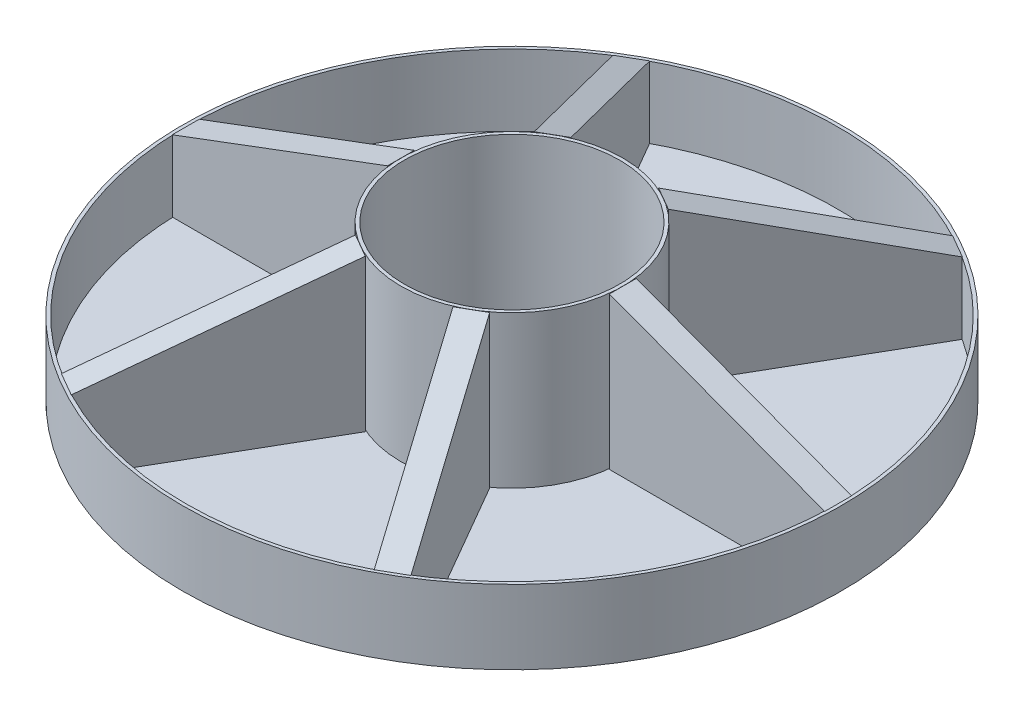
ISO-10303-21;
HEADER;
FILE_DESCRIPTION(('STEP AP214'),'2;1');
FILE_NAME('part.step','',(''),(''),'','','');
FILE_SCHEMA(('AUTOMOTIVE_DESIGN { 1 0 10303 214 1 1 1 1 }'));
ENDSEC;
DATA;
#1=APPLICATION_CONTEXT('core data for automotive mechanical design processes');
#2=APPLICATION_PROTOCOL_DEFINITION('international standard','automotive_design',2000,#1);
#3=PRODUCT_CONTEXT('',#1,'mechanical');
#4=PRODUCT('Part','Part','',(#3));
#5=PRODUCT_RELATED_PRODUCT_CATEGORY('part','',(#4));
#6=PRODUCT_DEFINITION_FORMATION('','',#4);
#7=PRODUCT_DEFINITION_CONTEXT('part definition',#1,'design');
#8=PRODUCT_DEFINITION('design','',#6,#7);
#9=PRODUCT_DEFINITION_SHAPE('','',#8);
#10=(LENGTH_UNIT() NAMED_UNIT(*) SI_UNIT(.MILLI.,.METRE.));
#11=(NAMED_UNIT(*) PLANE_ANGLE_UNIT() SI_UNIT($,.RADIAN.));
#12=(NAMED_UNIT(*) SI_UNIT($,.STERADIAN.) SOLID_ANGLE_UNIT());
#13=UNCERTAINTY_MEASURE_WITH_UNIT(LENGTH_MEASURE(1.E-05),#10,'distance_accuracy_value','');
#14=(GEOMETRIC_REPRESENTATION_CONTEXT(3) GLOBAL_UNCERTAINTY_ASSIGNED_CONTEXT((#13)) GLOBAL_UNIT_ASSIGNED_CONTEXT((#10,
#11,#12)) REPRESENTATION_CONTEXT('',''));
#15=CARTESIAN_POINT('',(0.,0.,0.));
#16=DIRECTION('',(0.,0.,1.));
#17=DIRECTION('',(1.,0.,0.));
#18=AXIS2_PLACEMENT_3D('',#15,#16,#17);
#19=CARTESIAN_POINT('',(-0.433012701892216,0.1,0.250000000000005));
#20=DIRECTION('',(0.,-1.,0.));
#21=DIRECTION('',(0.50000000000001,0.,0.866025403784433));
#22=AXIS2_PLACEMENT_3D('',#19,#20,#21);
#23=PLANE('',#22);
#24=DIRECTION('',(-0.50000000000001,0.,-0.866025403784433));
#25=VECTOR('',#24,1.);
#26=CARTESIAN_POINT('',(0.433012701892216,0.1,-0.250000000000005));
#27=LINE('',#26,#25);
#28=CARTESIAN_POINT('',(-1.62948729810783,0.1,-3.82235479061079));
#29=VERTEX_POINT('',#28);
#30=CARTESIAN_POINT('',(-5.6294872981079,0.0999999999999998,-10.7505580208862));
#31=VERTEX_POINT('',#30);
#32=EDGE_CURVE('E124',#29,#31,#27,.T.);
#33=ORIENTED_EDGE('',*,*,#32,.F.);
#34=DIRECTION('',(0.866025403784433,0.,-0.50000000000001));
#35=VECTOR('',#34,1.);
#36=CARTESIAN_POINT('',(-2.49551270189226,0.1,-3.32235479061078));
#37=LINE('',#36,#35);
#38=CARTESIAN_POINT('',(-2.49551270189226,0.1,-3.32235479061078));
#39=VERTEX_POINT('',#38);
#40=EDGE_CURVE('E13',#39,#29,#37,.T.);
#41=ORIENTED_EDGE('',*,*,#40,.F.);
#42=DIRECTION('',(-0.50000000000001,0.,-0.866025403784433));
#43=VECTOR('',#42,1.);
#44=CARTESIAN_POINT('',(-0.433012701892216,0.1,0.250000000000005));
#45=LINE('',#44,#43);
#46=CARTESIAN_POINT('',(-6.49551270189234,0.0999999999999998,-10.2505580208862));
#47=VERTEX_POINT('',#46);
#48=EDGE_CURVE('E107',#39,#47,#45,.T.);
#49=ORIENTED_EDGE('',*,*,#48,.T.);
#50=DIRECTION('',(0.866025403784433,0.,-0.50000000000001));
#51=VECTOR('',#50,1.);
#52=CARTESIAN_POINT('',(-6.49551270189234,0.0999999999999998,-10.2505580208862));
#53=LINE('',#52,#51);
#54=EDGE_CURVE('E78',#47,#31,#53,.T.);
#55=ORIENTED_EDGE('',*,*,#54,.T.);
#56=EDGE_LOOP('',(#33,#41,#49,#55));
#57=FACE_BOUND('',#56,.T.);
#58=ADVANCED_FACE('F58',(#57),#23,.T.);
#59=CARTESIAN_POINT('',(-2.49551270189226,0.,-3.32235479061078));
#60=DIRECTION('',(-0.50000000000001,0.,-0.866025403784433));
#61=DIRECTION('',(-0.866025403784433,0.,0.50000000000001));
#62=AXIS2_PLACEMENT_3D('',#59,#60,#61);
#63=PLANE('',#62);
#64=DIRECTION('',(0.,1.,0.));
#65=VECTOR('',#64,1.);
#66=CARTESIAN_POINT('',(-1.62948729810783,0.,-3.82235479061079));
#67=LINE('',#66,#65);
#68=CARTESIAN_POINT('',(-1.62948729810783,5.75,-3.82235479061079));
#69=VERTEX_POINT('',#68);
#70=EDGE_CURVE('E111',#29,#69,#67,.T.);
#71=ORIENTED_EDGE('',*,*,#70,.T.);
#72=DIRECTION('',(0.866025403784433,0.,-0.50000000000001));
#73=VECTOR('',#72,1.);
#74=CARTESIAN_POINT('',(-2.49551270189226,5.75,-3.32235479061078));
#75=LINE('',#74,#73);
#76=CARTESIAN_POINT('',(-2.49551270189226,5.75,-3.32235479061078));
#77=VERTEX_POINT('',#76);
#78=EDGE_CURVE('E69',#77,#69,#75,.T.);
#79=ORIENTED_EDGE('',*,*,#78,.F.);
#80=DIRECTION('',(0.,1.,0.));
#81=VECTOR('',#80,1.);
#82=CARTESIAN_POINT('',(-2.49551270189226,0.,-3.32235479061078));
#83=LINE('',#82,#81);
#84=EDGE_CURVE('E105',#39,#77,#83,.T.);
#85=ORIENTED_EDGE('',*,*,#84,.F.);
#86=ORIENTED_EDGE('',*,*,#40,.T.);
#87=EDGE_LOOP('',(#71,#79,#85,#86));
#88=FACE_BOUND('',#87,.T.);
#89=ADVANCED_FACE('F115',(#88),#63,.F.);
#90=CARTESIAN_POINT('',(-1.6324990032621,6.3972602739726,-1.82757121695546));
#91=DIRECTION('',(0.1755617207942,-0.936329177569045,0.304081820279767));
#92=DIRECTION('',(0.468164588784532,0.351123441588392,0.810884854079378));
#93=AXIS2_PLACEMENT_3D('',#90,#91,#92);
#94=PLANE('',#93);
#95=DIRECTION('',(-0.468164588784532,-0.351123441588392,-0.810884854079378));
#96=VECTOR('',#95,1.);
#97=CARTESIAN_POINT('',(-0.766473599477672,6.3972602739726,-2.32757121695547));
#98=LINE('',#97,#96);
#99=CARTESIAN_POINT('',(-5.6294872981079,2.75,-10.7505580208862));
#100=VERTEX_POINT('',#99);
#101=EDGE_CURVE('E127',#69,#100,#98,.T.);
#102=ORIENTED_EDGE('',*,*,#101,.T.);
#103=DIRECTION('',(0.866025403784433,0.,-0.50000000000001));
#104=VECTOR('',#103,1.);
#105=CARTESIAN_POINT('',(-6.49551270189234,2.75,-10.2505580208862));
#106=LINE('',#105,#104);
#107=CARTESIAN_POINT('',(-6.49551270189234,2.75,-10.2505580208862));
#108=VERTEX_POINT('',#107);
#109=EDGE_CURVE('E89',#108,#100,#106,.T.);
#110=ORIENTED_EDGE('',*,*,#109,.F.);
#111=DIRECTION('',(-0.468164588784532,-0.351123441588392,-0.810884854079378));
#112=VECTOR('',#111,1.);
#113=CARTESIAN_POINT('',(-1.6324990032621,6.3972602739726,-1.82757121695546));
#114=LINE('',#113,#112);
#115=EDGE_CURVE('E110',#77,#108,#114,.T.);
#116=ORIENTED_EDGE('',*,*,#115,.F.);
#117=ORIENTED_EDGE('',*,*,#78,.T.);
#118=EDGE_LOOP('',(#102,#110,#116,#117));
#119=FACE_BOUND('',#118,.T.);
#120=ADVANCED_FACE('F119',(#119),#94,.F.);
#121=CARTESIAN_POINT('',(-6.49551270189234,0.,-10.2505580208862));
#122=DIRECTION('',(-0.50000000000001,0.,-0.866025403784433));
#123=DIRECTION('',(-0.866025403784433,0.,0.50000000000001));
#124=AXIS2_PLACEMENT_3D('',#121,#122,#123);
#125=PLANE('',#124);
#126=DIRECTION('',(0.,1.,0.));
#127=VECTOR('',#126,1.);
#128=CARTESIAN_POINT('',(-5.6294872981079,0.,-10.7505580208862));
#129=LINE('',#128,#127);
#130=EDGE_CURVE('E126',#31,#100,#129,.T.);
#131=ORIENTED_EDGE('',*,*,#130,.F.);
#132=ORIENTED_EDGE('',*,*,#54,.F.);
#133=DIRECTION('',(0.,1.,0.));
#134=VECTOR('',#133,1.);
#135=CARTESIAN_POINT('',(-6.49551270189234,0.,-10.2505580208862));
#136=LINE('',#135,#134);
#137=EDGE_CURVE('E117',#47,#108,#136,.T.);
#138=ORIENTED_EDGE('',*,*,#137,.T.);
#139=ORIENTED_EDGE('',*,*,#109,.T.);
#140=EDGE_LOOP('',(#131,#132,#138,#139));
#141=FACE_BOUND('',#140,.T.);
#142=ADVANCED_FACE('F132',(#141),#125,.T.);
#143=CARTESIAN_POINT('',(-0.433012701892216,0.,0.250000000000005));
#144=DIRECTION('',(-0.866025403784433,0.,0.50000000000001));
#145=DIRECTION('',(0.50000000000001,0.,0.866025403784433));
#146=AXIS2_PLACEMENT_3D('',#143,#144,#145);
#147=PLANE('',#146);
#148=ORIENTED_EDGE('',*,*,#48,.F.);
#149=ORIENTED_EDGE('',*,*,#84,.T.);
#150=ORIENTED_EDGE('',*,*,#115,.T.);
#151=ORIENTED_EDGE('',*,*,#137,.F.);
#152=EDGE_LOOP('',(#148,#149,#150,#151));
#153=FACE_BOUND('',#152,.T.);
#154=ADVANCED_FACE('F102',(#153),#147,.T.);
#155=CARTESIAN_POINT('',(0.433012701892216,0.,-0.250000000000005));
#156=DIRECTION('',(-0.866025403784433,0.,0.50000000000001));
#157=DIRECTION('',(0.50000000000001,0.,0.866025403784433));
#158=AXIS2_PLACEMENT_3D('',#155,#156,#157);
#159=PLANE('',#158);
#160=ORIENTED_EDGE('',*,*,#32,.T.);
#161=ORIENTED_EDGE('',*,*,#130,.T.);
#162=ORIENTED_EDGE('',*,*,#101,.F.);
#163=ORIENTED_EDGE('',*,*,#70,.F.);
#164=EDGE_LOOP('',(#160,#161,#162,#163));
#165=FACE_BOUND('',#164,.T.);
#166=ADVANCED_FACE('F138',(#165),#159,.F.);
#167=CLOSED_SHELL('',(#58,#89,#120,#142,#154,#166));
#168=MANIFOLD_SOLID_BREP('B2',#167);
#169=CARTESIAN_POINT('',(-0.433012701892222,0.1,-0.249999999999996));
#170=DIRECTION('',(0.,-1.,0.));
#171=DIRECTION('',(-0.499999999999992,0.,0.866025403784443));
#172=AXIS2_PLACEMENT_3D('',#169,#170,#171);
#173=PLANE('',#172);
#174=DIRECTION('',(0.499999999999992,0.,-0.866025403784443));
#175=VECTOR('',#174,1.);
#176=CARTESIAN_POINT('',(0.433012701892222,0.1,0.249999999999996));
#177=LINE('',#176,#175);
#178=CARTESIAN_POINT('',(2.49551270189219,0.1,-3.32235479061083));
#179=VERTEX_POINT('',#178);
#180=CARTESIAN_POINT('',(6.49551270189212,0.0999999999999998,-10.2505580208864));
#181=VERTEX_POINT('',#180);
#182=EDGE_CURVE('E249',#179,#181,#177,.T.);
#183=ORIENTED_EDGE('',*,*,#182,.F.);
#184=DIRECTION('',(0.866025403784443,0.,0.499999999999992));
#185=VECTOR('',#184,1.);
#186=CARTESIAN_POINT('',(1.62948729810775,0.1,-3.82235479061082));
#187=LINE('',#186,#185);
#188=CARTESIAN_POINT('',(1.62948729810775,0.1,-3.82235479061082));
#189=VERTEX_POINT('',#188);
#190=EDGE_CURVE('E59',#189,#179,#187,.T.);
#191=ORIENTED_EDGE('',*,*,#190,.F.);
#192=DIRECTION('',(0.499999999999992,0.,-0.866025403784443));
#193=VECTOR('',#192,1.);
#194=CARTESIAN_POINT('',(-0.433012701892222,0.1,-0.249999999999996));
#195=LINE('',#194,#193);
#196=CARTESIAN_POINT('',(5.62948729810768,0.0999999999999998,-10.7505580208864));
#197=VERTEX_POINT('',#196);
#198=EDGE_CURVE('E234',#189,#197,#195,.T.);
#199=ORIENTED_EDGE('',*,*,#198,.T.);
#200=DIRECTION('',(0.866025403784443,0.,0.499999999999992));
#201=VECTOR('',#200,1.);
#202=CARTESIAN_POINT('',(5.62948729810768,0.0999999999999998,-10.7505580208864));
#203=LINE('',#202,#201);
#204=EDGE_CURVE('E203',#197,#181,#203,.T.);
#205=ORIENTED_EDGE('',*,*,#204,.T.);
#206=EDGE_LOOP('',(#183,#191,#199,#205));
#207=FACE_BOUND('',#206,.T.);
#208=ADVANCED_FACE('F183',(#207),#173,.T.);
#209=CARTESIAN_POINT('',(1.62948729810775,0.,-3.82235479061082));
#210=DIRECTION('',(0.499999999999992,0.,-0.866025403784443));
#211=DIRECTION('',(-0.866025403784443,0.,-0.499999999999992));
#212=AXIS2_PLACEMENT_3D('',#209,#210,#211);
#213=PLANE('',#212);
#214=DIRECTION('',(0.,1.,0.));
#215=VECTOR('',#214,1.);
#216=CARTESIAN_POINT('',(2.49551270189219,0.,-3.32235479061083));
#217=LINE('',#216,#215);
#218=CARTESIAN_POINT('',(2.49551270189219,5.75,-3.32235479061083));
#219=VERTEX_POINT('',#218);
#220=EDGE_CURVE('E239',#179,#219,#217,.T.);
#221=ORIENTED_EDGE('',*,*,#220,.T.);
#222=DIRECTION('',(0.866025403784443,0.,0.499999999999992));
#223=VECTOR('',#222,1.);
#224=CARTESIAN_POINT('',(1.62948729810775,5.75,-3.82235479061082));
#225=LINE('',#224,#223);
#226=CARTESIAN_POINT('',(1.62948729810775,5.75,-3.82235479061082));
#227=VERTEX_POINT('',#226);
#228=EDGE_CURVE('E194',#227,#219,#225,.T.);
#229=ORIENTED_EDGE('',*,*,#228,.F.);
#230=DIRECTION('',(0.,1.,0.));
#231=VECTOR('',#230,1.);
#232=CARTESIAN_POINT('',(1.62948729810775,0.,-3.82235479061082));
#233=LINE('',#232,#231);
#234=EDGE_CURVE('E229',#189,#227,#233,.T.);
#235=ORIENTED_EDGE('',*,*,#234,.F.);
#236=ORIENTED_EDGE('',*,*,#190,.T.);
#237=EDGE_LOOP('',(#221,#229,#235,#236));
#238=FACE_BOUND('',#237,.T.);
#239=ADVANCED_FACE('F240',(#238),#213,.F.);
#240=CARTESIAN_POINT('',(0.766473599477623,6.3972602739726,-2.32757121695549));
#241=DIRECTION('',(-0.175561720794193,-0.936329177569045,0.30408182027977));
#242=DIRECTION('',(-0.468164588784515,0.351123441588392,0.810884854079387));
#243=AXIS2_PLACEMENT_3D('',#240,#241,#242);
#244=PLANE('',#243);
#245=DIRECTION('',(0.468164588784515,-0.351123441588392,-0.810884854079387));
#246=VECTOR('',#245,1.);
#247=CARTESIAN_POINT('',(1.63249900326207,6.3972602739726,-1.82757121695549));
#248=LINE('',#247,#246);
#249=CARTESIAN_POINT('',(6.49551270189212,2.75,-10.2505580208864));
#250=VERTEX_POINT('',#249);
#251=EDGE_CURVE('E253',#219,#250,#248,.T.);
#252=ORIENTED_EDGE('',*,*,#251,.T.);
#253=DIRECTION('',(0.866025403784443,0.,0.499999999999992));
#254=VECTOR('',#253,1.);
#255=CARTESIAN_POINT('',(5.62948729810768,2.75,-10.7505580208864));
#256=LINE('',#255,#254);
#257=CARTESIAN_POINT('',(5.62948729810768,2.75,-10.7505580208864));
#258=VERTEX_POINT('',#257);
#259=EDGE_CURVE('E214',#258,#250,#256,.T.);
#260=ORIENTED_EDGE('',*,*,#259,.F.);
#261=DIRECTION('',(0.468164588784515,-0.351123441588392,-0.810884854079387));
#262=VECTOR('',#261,1.);
#263=CARTESIAN_POINT('',(0.766473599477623,6.3972602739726,-2.32757121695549));
#264=LINE('',#263,#262);
#265=EDGE_CURVE('E235',#227,#258,#264,.T.);
#266=ORIENTED_EDGE('',*,*,#265,.F.);
#267=ORIENTED_EDGE('',*,*,#228,.T.);
#268=EDGE_LOOP('',(#252,#260,#266,#267));
#269=FACE_BOUND('',#268,.T.);
#270=ADVANCED_FACE('F244',(#269),#244,.F.);
#271=CARTESIAN_POINT('',(5.62948729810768,0.,-10.7505580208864));
#272=DIRECTION('',(0.499999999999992,0.,-0.866025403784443));
#273=DIRECTION('',(-0.866025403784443,0.,-0.499999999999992));
#274=AXIS2_PLACEMENT_3D('',#271,#272,#273);
#275=PLANE('',#274);
#276=DIRECTION('',(0.,1.,0.));
#277=VECTOR('',#276,1.);
#278=CARTESIAN_POINT('',(6.49551270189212,0.,-10.2505580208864));
#279=LINE('',#278,#277);
#280=EDGE_CURVE('E251',#181,#250,#279,.T.);
#281=ORIENTED_EDGE('',*,*,#280,.F.);
#282=ORIENTED_EDGE('',*,*,#204,.F.);
#283=DIRECTION('',(0.,1.,0.));
#284=VECTOR('',#283,1.);
#285=CARTESIAN_POINT('',(5.62948729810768,0.,-10.7505580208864));
#286=LINE('',#285,#284);
#287=EDGE_CURVE('E242',#197,#258,#286,.T.);
#288=ORIENTED_EDGE('',*,*,#287,.T.);
#289=ORIENTED_EDGE('',*,*,#259,.T.);
#290=EDGE_LOOP('',(#281,#282,#288,#289));
#291=FACE_BOUND('',#290,.T.);
#292=ADVANCED_FACE('F256',(#291),#275,.T.);
#293=CARTESIAN_POINT('',(-0.433012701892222,0.,-0.249999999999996));
#294=DIRECTION('',(-0.866025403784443,0.,-0.499999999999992));
#295=DIRECTION('',(-0.499999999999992,0.,0.866025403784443));
#296=AXIS2_PLACEMENT_3D('',#293,#294,#295);
#297=PLANE('',#296);
#298=ORIENTED_EDGE('',*,*,#198,.F.);
#299=ORIENTED_EDGE('',*,*,#234,.T.);
#300=ORIENTED_EDGE('',*,*,#265,.T.);
#301=ORIENTED_EDGE('',*,*,#287,.F.);
#302=EDGE_LOOP('',(#298,#299,#300,#301));
#303=FACE_BOUND('',#302,.T.);
#304=ADVANCED_FACE('F230',(#303),#297,.T.);
#305=CARTESIAN_POINT('',(0.433012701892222,0.,0.249999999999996));
#306=DIRECTION('',(-0.866025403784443,0.,-0.499999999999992));
#307=DIRECTION('',(-0.499999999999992,0.,0.866025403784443));
#308=AXIS2_PLACEMENT_3D('',#305,#306,#307);
#309=PLANE('',#308);
#310=ORIENTED_EDGE('',*,*,#182,.T.);
#311=ORIENTED_EDGE('',*,*,#280,.T.);
#312=ORIENTED_EDGE('',*,*,#251,.F.);
#313=ORIENTED_EDGE('',*,*,#220,.F.);
#314=EDGE_LOOP('',(#310,#311,#312,#313));
#315=FACE_BOUND('',#314,.T.);
#316=ADVANCED_FACE('F264',(#315),#309,.F.);
#317=CLOSED_SHELL('',(#208,#239,#270,#292,#304,#316));
#318=MANIFOLD_SOLID_BREP('B7',#317);
#319=CARTESIAN_POINT('',(0.,0.1,-0.5));
#320=DIRECTION('',(0.,-1.,0.));
#321=DIRECTION('',(-1.,0.,0.));
#322=AXIS2_PLACEMENT_3D('',#319,#320,#321);
#323=PLANE('',#322);
#324=DIRECTION('',(1.,0.,0.));
#325=VECTOR('',#324,1.);
#326=CARTESIAN_POINT('',(0.,0.1,0.5));
#327=LINE('',#326,#325);
#328=CARTESIAN_POINT('',(4.125,0.1,0.5));
#329=VERTEX_POINT('',#328);
#330=CARTESIAN_POINT('',(12.125,0.0999999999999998,0.5));
#331=VERTEX_POINT('',#330);
#332=EDGE_CURVE('E373',#329,#331,#327,.T.);
#333=ORIENTED_EDGE('',*,*,#332,.F.);
#334=DIRECTION('',(0.,0.,1.));
#335=VECTOR('',#334,1.);
#336=CARTESIAN_POINT('',(4.125,0.1,-0.5));
#337=LINE('',#336,#335);
#338=CARTESIAN_POINT('',(4.125,0.1,-0.5));
#339=VERTEX_POINT('',#338);
#340=EDGE_CURVE('E181',#339,#329,#337,.T.);
#341=ORIENTED_EDGE('',*,*,#340,.F.);
#342=DIRECTION('',(1.,0.,0.));
#343=VECTOR('',#342,1.);
#344=CARTESIAN_POINT('',(0.,0.1,-0.5));
#345=LINE('',#344,#343);
#346=CARTESIAN_POINT('',(12.125,0.0999999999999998,-0.5));
#347=VERTEX_POINT('',#346);
#348=EDGE_CURVE('E359',#339,#347,#345,.T.);
#349=ORIENTED_EDGE('',*,*,#348,.T.);
#350=DIRECTION('',(0.,0.,1.));
#351=VECTOR('',#350,1.);
#352=CARTESIAN_POINT('',(12.125,0.0999999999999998,-0.5));
#353=LINE('',#352,#351);
#354=EDGE_CURVE('E326',#347,#331,#353,.T.);
#355=ORIENTED_EDGE('',*,*,#354,.T.);
#356=EDGE_LOOP('',(#333,#341,#349,#355));
#357=FACE_BOUND('',#356,.T.);
#358=ADVANCED_FACE('F309',(#357),#323,.T.);
#359=CARTESIAN_POINT('',(4.125,0.,-0.5));
#360=DIRECTION('',(1.,0.,0.));
#361=DIRECTION('',(0.,0.,-1.));
#362=AXIS2_PLACEMENT_3D('',#359,#360,#361);
#363=PLANE('',#362);
#364=DIRECTION('',(0.,1.,0.));
#365=VECTOR('',#364,1.);
#366=CARTESIAN_POINT('',(4.125,0.,0.5));
#367=LINE('',#366,#365);
#368=CARTESIAN_POINT('',(4.125,5.75,0.5));
#369=VERTEX_POINT('',#368);
#370=EDGE_CURVE('E365',#329,#369,#367,.T.);
#371=ORIENTED_EDGE('',*,*,#370,.T.);
#372=DIRECTION('',(0.,0.,1.));
#373=VECTOR('',#372,1.);
#374=CARTESIAN_POINT('',(4.125,5.75,-0.5));
#375=LINE('',#374,#373);
#376=CARTESIAN_POINT('',(4.125,5.75,-0.5));
#377=VERTEX_POINT('',#376);
#378=EDGE_CURVE('E318',#377,#369,#375,.T.);
#379=ORIENTED_EDGE('',*,*,#378,.F.);
#380=DIRECTION('',(0.,1.,0.));
#381=VECTOR('',#380,1.);
#382=CARTESIAN_POINT('',(4.125,0.,-0.5));
#383=LINE('',#382,#381);
#384=EDGE_CURVE('E354',#339,#377,#383,.T.);
#385=ORIENTED_EDGE('',*,*,#384,.F.);
#386=ORIENTED_EDGE('',*,*,#340,.T.);
#387=EDGE_LOOP('',(#371,#379,#385,#386));
#388=FACE_BOUND('',#387,.T.);
#389=ADVANCED_FACE('F362',(#388),#363,.F.);
#390=CARTESIAN_POINT('',(2.39897260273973,6.3972602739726,-0.5));
#391=DIRECTION('',(-0.351123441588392,-0.936329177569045,0.));
#392=DIRECTION('',(-0.936329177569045,0.351123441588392,0.));
#393=AXIS2_PLACEMENT_3D('',#390,#391,#392);
#394=PLANE('',#393);
#395=DIRECTION('',(0.936329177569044,-0.351123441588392,0.));
#396=VECTOR('',#395,1.);
#397=CARTESIAN_POINT('',(2.39897260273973,6.3972602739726,0.5));
#398=LINE('',#397,#396);
#399=CARTESIAN_POINT('',(12.125,2.75,0.5));
#400=VERTEX_POINT('',#399);
#401=EDGE_CURVE('E376',#369,#400,#398,.T.);
#402=ORIENTED_EDGE('',*,*,#401,.T.);
#403=DIRECTION('',(0.,0.,1.));
#404=VECTOR('',#403,1.);
#405=CARTESIAN_POINT('',(12.125,2.75,-0.5));
#406=LINE('',#405,#404);
#407=CARTESIAN_POINT('',(12.125,2.75,-0.5));
#408=VERTEX_POINT('',#407);
#409=EDGE_CURVE('E336',#408,#400,#406,.T.);
#410=ORIENTED_EDGE('',*,*,#409,.F.);
#411=DIRECTION('',(0.936329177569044,-0.351123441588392,0.));
#412=VECTOR('',#411,1.);
#413=CARTESIAN_POINT('',(2.39897260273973,6.3972602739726,-0.5));
#414=LINE('',#413,#412);
#415=EDGE_CURVE('E360',#377,#408,#414,.T.);
#416=ORIENTED_EDGE('',*,*,#415,.F.);
#417=ORIENTED_EDGE('',*,*,#378,.T.);
#418=EDGE_LOOP('',(#402,#410,#416,#417));
#419=FACE_BOUND('',#418,.T.);
#420=ADVANCED_FACE('F370',(#419),#394,.F.);
#421=CARTESIAN_POINT('',(12.125,0.,-0.5));
#422=DIRECTION('',(1.,0.,0.));
#423=DIRECTION('',(0.,0.,-1.));
#424=AXIS2_PLACEMENT_3D('',#421,#422,#423);
#425=PLANE('',#424);
#426=DIRECTION('',(0.,1.,0.));
#427=VECTOR('',#426,1.);
#428=CARTESIAN_POINT('',(12.125,0.,0.5));
#429=LINE('',#428,#427);
#430=EDGE_CURVE('E378',#331,#400,#429,.T.);
#431=ORIENTED_EDGE('',*,*,#430,.F.);
#432=ORIENTED_EDGE('',*,*,#354,.F.);
#433=DIRECTION('',(0.,1.,0.));
#434=VECTOR('',#433,1.);
#435=CARTESIAN_POINT('',(12.125,0.,-0.5));
#436=LINE('',#435,#434);
#437=EDGE_CURVE('E366',#347,#408,#436,.T.);
#438=ORIENTED_EDGE('',*,*,#437,.T.);
#439=ORIENTED_EDGE('',*,*,#409,.T.);
#440=EDGE_LOOP('',(#431,#432,#438,#439));
#441=FACE_BOUND('',#440,.T.);
#442=ADVANCED_FACE('F382',(#441),#425,.T.);
#443=CARTESIAN_POINT('',(0.,0.,-0.5));
#444=DIRECTION('',(0.,0.,-1.));
#445=DIRECTION('',(-1.,0.,0.));
#446=AXIS2_PLACEMENT_3D('',#443,#444,#445);
#447=PLANE('',#446);
#448=ORIENTED_EDGE('',*,*,#348,.F.);
#449=ORIENTED_EDGE('',*,*,#384,.T.);
#450=ORIENTED_EDGE('',*,*,#415,.T.);
#451=ORIENTED_EDGE('',*,*,#437,.F.);
#452=EDGE_LOOP('',(#448,#449,#450,#451));
#453=FACE_BOUND('',#452,.T.);
#454=ADVANCED_FACE('F355',(#453),#447,.T.);
#455=CARTESIAN_POINT('',(0.,0.,0.5));
#456=DIRECTION('',(0.,0.,-1.));
#457=DIRECTION('',(-1.,0.,0.));
#458=AXIS2_PLACEMENT_3D('',#455,#456,#457);
#459=PLANE('',#458);
#460=ORIENTED_EDGE('',*,*,#332,.T.);
#461=ORIENTED_EDGE('',*,*,#430,.T.);
#462=ORIENTED_EDGE('',*,*,#401,.F.);
#463=ORIENTED_EDGE('',*,*,#370,.F.);
#464=EDGE_LOOP('',(#460,#461,#462,#463));
#465=FACE_BOUND('',#464,.T.);
#466=ADVANCED_FACE('F388',(#465),#459,.F.);
#467=CLOSED_SHELL('',(#358,#389,#420,#442,#454,#466));
#468=MANIFOLD_SOLID_BREP('B55',#467);
#469=CARTESIAN_POINT('',(0.433012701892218,0.1,-0.250000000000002));
#470=DIRECTION('',(0.,-1.,0.));
#471=DIRECTION('',(-0.500000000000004,0.,-0.866025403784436));
#472=AXIS2_PLACEMENT_3D('',#469,#470,#471);
#473=PLANE('',#472);
#474=DIRECTION('',(0.500000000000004,0.,0.866025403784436));
#475=VECTOR('',#474,1.);
#476=CARTESIAN_POINT('',(-0.433012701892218,0.1,0.250000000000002));
#477=LINE('',#476,#475);
#478=CARTESIAN_POINT('',(1.6294872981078,0.1,3.8223547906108));
#479=VERTEX_POINT('',#478);
#480=CARTESIAN_POINT('',(5.62948729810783,0.0999999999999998,10.7505580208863));
#481=VERTEX_POINT('',#480);
#482=EDGE_CURVE('E499',#479,#481,#477,.T.);
#483=ORIENTED_EDGE('',*,*,#482,.F.);
#484=DIRECTION('',(-0.866025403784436,0.,0.500000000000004));
#485=VECTOR('',#484,1.);
#486=CARTESIAN_POINT('',(2.49551270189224,0.1,3.3223547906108));
#487=LINE('',#486,#485);
#488=CARTESIAN_POINT('',(2.49551270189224,0.1,3.3223547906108));
#489=VERTEX_POINT('',#488);
#490=EDGE_CURVE('E306',#489,#479,#487,.T.);
#491=ORIENTED_EDGE('',*,*,#490,.F.);
#492=DIRECTION('',(0.500000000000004,0.,0.866025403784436));
#493=VECTOR('',#492,1.);
#494=CARTESIAN_POINT('',(0.433012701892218,0.1,-0.250000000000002));
#495=LINE('',#494,#493);
#496=CARTESIAN_POINT('',(6.49551270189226,0.0999999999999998,10.2505580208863));
#497=VERTEX_POINT('',#496);
#498=EDGE_CURVE('E483',#489,#497,#495,.T.);
#499=ORIENTED_EDGE('',*,*,#498,.T.);
#500=DIRECTION('',(-0.866025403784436,0.,0.500000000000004));
#501=VECTOR('',#500,1.);
#502=CARTESIAN_POINT('',(6.49551270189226,0.0999999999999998,10.2505580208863));
#503=LINE('',#502,#501);
#504=EDGE_CURVE('E452',#497,#481,#503,.T.);
#505=ORIENTED_EDGE('',*,*,#504,.T.);
#506=EDGE_LOOP('',(#483,#491,#499,#505));
#507=FACE_BOUND('',#506,.T.);
#508=ADVANCED_FACE('F434',(#507),#473,.T.);
#509=CARTESIAN_POINT('',(2.49551270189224,0.,3.3223547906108));
#510=DIRECTION('',(0.500000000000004,0.,0.866025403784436));
#511=DIRECTION('',(0.866025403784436,0.,-0.500000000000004));
#512=AXIS2_PLACEMENT_3D('',#509,#510,#511);
#513=PLANE('',#512);
#514=DIRECTION('',(0.,1.,0.));
#515=VECTOR('',#514,1.);
#516=CARTESIAN_POINT('',(1.6294872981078,0.,3.8223547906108));
#517=LINE('',#516,#515);
#518=CARTESIAN_POINT('',(1.6294872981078,5.75,3.8223547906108));
#519=VERTEX_POINT('',#518);
#520=EDGE_CURVE('E487',#479,#519,#517,.T.);
#521=ORIENTED_EDGE('',*,*,#520,.T.);
#522=DIRECTION('',(-0.866025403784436,0.,0.500000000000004));
#523=VECTOR('',#522,1.);
#524=CARTESIAN_POINT('',(2.49551270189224,5.75,3.3223547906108));
#525=LINE('',#524,#523);
#526=CARTESIAN_POINT('',(2.49551270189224,5.75,3.3223547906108));
#527=VERTEX_POINT('',#526);
#528=EDGE_CURVE('E444',#527,#519,#525,.T.);
#529=ORIENTED_EDGE('',*,*,#528,.F.);
#530=DIRECTION('',(0.,1.,0.));
#531=VECTOR('',#530,1.);
#532=CARTESIAN_POINT('',(2.49551270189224,0.,3.3223547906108));
#533=LINE('',#532,#531);
#534=EDGE_CURVE('E480',#489,#527,#533,.T.);
#535=ORIENTED_EDGE('',*,*,#534,.F.);
#536=ORIENTED_EDGE('',*,*,#490,.T.);
#537=EDGE_LOOP('',(#521,#529,#535,#536));
#538=FACE_BOUND('',#537,.T.);
#539=ADVANCED_FACE('F490',(#538),#513,.F.);
#540=CARTESIAN_POINT('',(1.63249900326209,6.3972602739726,1.82757121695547));
#541=DIRECTION('',(-0.175561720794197,-0.936329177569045,-0.304081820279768));
#542=DIRECTION('',(-0.468164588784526,0.351123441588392,-0.810884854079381));
#543=AXIS2_PLACEMENT_3D('',#540,#541,#542);
#544=PLANE('',#543);
#545=DIRECTION('',(0.468164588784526,-0.351123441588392,0.810884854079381));
#546=VECTOR('',#545,1.);
#547=CARTESIAN_POINT('',(0.766473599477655,6.3972602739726,2.32757121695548));
#548=LINE('',#547,#546);
#549=CARTESIAN_POINT('',(5.62948729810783,2.75,10.7505580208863));
#550=VERTEX_POINT('',#549);
#551=EDGE_CURVE('E503',#519,#550,#548,.T.);
#552=ORIENTED_EDGE('',*,*,#551,.T.);
#553=DIRECTION('',(-0.866025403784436,0.,0.500000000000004));
#554=VECTOR('',#553,1.);
#555=CARTESIAN_POINT('',(6.49551270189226,2.75,10.2505580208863));
#556=LINE('',#555,#554);
#557=CARTESIAN_POINT('',(6.49551270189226,2.75,10.2505580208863));
#558=VERTEX_POINT('',#557);
#559=EDGE_CURVE('E461',#558,#550,#556,.T.);
#560=ORIENTED_EDGE('',*,*,#559,.F.);
#561=DIRECTION('',(0.468164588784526,-0.351123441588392,0.810884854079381));
#562=VECTOR('',#561,1.);
#563=CARTESIAN_POINT('',(1.63249900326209,6.3972602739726,1.82757121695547));
#564=LINE('',#563,#562);
#565=EDGE_CURVE('E485',#527,#558,#564,.T.);
#566=ORIENTED_EDGE('',*,*,#565,.F.);
#567=ORIENTED_EDGE('',*,*,#528,.T.);
#568=EDGE_LOOP('',(#552,#560,#566,#567));
#569=FACE_BOUND('',#568,.T.);
#570=ADVANCED_FACE('F495',(#569),#544,.F.);
#571=CARTESIAN_POINT('',(6.49551270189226,0.,10.2505580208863));
#572=DIRECTION('',(0.500000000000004,0.,0.866025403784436));
#573=DIRECTION('',(0.866025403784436,0.,-0.500000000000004));
#574=AXIS2_PLACEMENT_3D('',#571,#572,#573);
#575=PLANE('',#574);
#576=DIRECTION('',(0.,1.,0.));
#577=VECTOR('',#576,1.);
#578=CARTESIAN_POINT('',(5.62948729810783,0.,10.7505580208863));
#579=LINE('',#578,#577);
#580=EDGE_CURVE('E502',#481,#550,#579,.T.);
#581=ORIENTED_EDGE('',*,*,#580,.F.);
#582=ORIENTED_EDGE('',*,*,#504,.F.);
#583=DIRECTION('',(0.,1.,0.));
#584=VECTOR('',#583,1.);
#585=CARTESIAN_POINT('',(6.49551270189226,0.,10.2505580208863));
#586=LINE('',#585,#584);
#587=EDGE_CURVE('E492',#497,#558,#586,.T.);
#588=ORIENTED_EDGE('',*,*,#587,.T.);
#589=ORIENTED_EDGE('',*,*,#559,.T.);
#590=EDGE_LOOP('',(#581,#582,#588,#589));
#591=FACE_BOUND('',#590,.T.);
#592=ADVANCED_FACE('F509',(#591),#575,.T.);
#593=CARTESIAN_POINT('',(0.433012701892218,0.,-0.250000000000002));
#594=DIRECTION('',(0.866025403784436,0.,-0.500000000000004));
#595=DIRECTION('',(-0.500000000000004,0.,-0.866025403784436));
#596=AXIS2_PLACEMENT_3D('',#593,#594,#595);
#597=PLANE('',#596);
#598=ORIENTED_EDGE('',*,*,#498,.F.);
#599=ORIENTED_EDGE('',*,*,#534,.T.);
#600=ORIENTED_EDGE('',*,*,#565,.T.);
#601=ORIENTED_EDGE('',*,*,#587,.F.);
#602=EDGE_LOOP('',(#598,#599,#600,#601));
#603=FACE_BOUND('',#602,.T.);
#604=ADVANCED_FACE('F479',(#603),#597,.T.);
#605=CARTESIAN_POINT('',(-0.433012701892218,0.,0.250000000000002));
#606=DIRECTION('',(0.866025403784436,0.,-0.500000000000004));
#607=DIRECTION('',(-0.500000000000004,0.,-0.866025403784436));
#608=AXIS2_PLACEMENT_3D('',#605,#606,#607);
#609=PLANE('',#608);
#610=ORIENTED_EDGE('',*,*,#482,.T.);
#611=ORIENTED_EDGE('',*,*,#580,.T.);
#612=ORIENTED_EDGE('',*,*,#551,.F.);
#613=ORIENTED_EDGE('',*,*,#520,.F.);
#614=EDGE_LOOP('',(#610,#611,#612,#613));
#615=FACE_BOUND('',#614,.T.);
#616=ADVANCED_FACE('F513',(#615),#609,.F.);
#617=CLOSED_SHELL('',(#508,#539,#570,#592,#604,#616));
#618=MANIFOLD_SOLID_BREP('B180',#617);
#619=CARTESIAN_POINT('',(0.43301270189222,0.1,0.249999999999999));
#620=DIRECTION('',(0.,-1.,0.));
#621=DIRECTION('',(0.499999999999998,0.,-0.86602540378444));
#622=AXIS2_PLACEMENT_3D('',#619,#620,#621);
#623=PLANE('',#622);
#624=DIRECTION('',(-0.499999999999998,0.,0.86602540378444));
#625=VECTOR('',#624,1.);
#626=CARTESIAN_POINT('',(-0.43301270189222,0.1,-0.249999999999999));
#627=LINE('',#626,#625);
#628=CARTESIAN_POINT('',(-2.49551270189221,0.1,3.32235479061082));
#629=VERTEX_POINT('',#628);
#630=CARTESIAN_POINT('',(-6.49551270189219,0.0999999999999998,10.2505580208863));
#631=VERTEX_POINT('',#630);
#632=EDGE_CURVE('E621',#629,#631,#627,.T.);
#633=ORIENTED_EDGE('',*,*,#632,.F.);
#634=DIRECTION('',(-0.86602540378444,0.,-0.499999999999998));
#635=VECTOR('',#634,1.);
#636=CARTESIAN_POINT('',(-1.62948729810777,0.1,3.82235479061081));
#637=LINE('',#636,#635);
#638=CARTESIAN_POINT('',(-1.62948729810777,0.1,3.82235479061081));
#639=VERTEX_POINT('',#638);
#640=EDGE_CURVE('E433',#639,#629,#637,.T.);
#641=ORIENTED_EDGE('',*,*,#640,.F.);
#642=DIRECTION('',(-0.499999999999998,0.,0.86602540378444));
#643=VECTOR('',#642,1.);
#644=CARTESIAN_POINT('',(0.43301270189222,0.1,0.249999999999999));
#645=LINE('',#644,#643);
#646=CARTESIAN_POINT('',(-5.62948729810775,0.0999999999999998,10.7505580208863));
#647=VERTEX_POINT('',#646);
#648=EDGE_CURVE('E609',#639,#647,#645,.T.);
#649=ORIENTED_EDGE('',*,*,#648,.T.);
#650=DIRECTION('',(-0.86602540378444,0.,-0.499999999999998));
#651=VECTOR('',#650,1.);
#652=CARTESIAN_POINT('',(-5.62948729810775,0.0999999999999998,10.7505580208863));
#653=LINE('',#652,#651);
#654=EDGE_CURVE('E577',#647,#631,#653,.T.);
#655=ORIENTED_EDGE('',*,*,#654,.T.);
#656=EDGE_LOOP('',(#633,#641,#649,#655));
#657=FACE_BOUND('',#656,.T.);
#658=ADVANCED_FACE('F556',(#657),#623,.T.);
#659=CARTESIAN_POINT('',(-1.62948729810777,0.,3.82235479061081));
#660=DIRECTION('',(-0.499999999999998,0.,0.86602540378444));
#661=DIRECTION('',(0.86602540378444,0.,0.499999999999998));
#662=AXIS2_PLACEMENT_3D('',#659,#660,#661);
#663=PLANE('',#662);
#664=DIRECTION('',(0.,1.,0.));
#665=VECTOR('',#664,1.);
#666=CARTESIAN_POINT('',(-2.49551270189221,0.,3.32235479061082));
#667=LINE('',#666,#665);
#668=CARTESIAN_POINT('',(-2.49551270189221,5.75,3.32235479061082));
#669=VERTEX_POINT('',#668);
#670=EDGE_CURVE('E615',#629,#669,#667,.T.);
#671=ORIENTED_EDGE('',*,*,#670,.T.);
#672=DIRECTION('',(-0.86602540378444,0.,-0.499999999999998));
#673=VECTOR('',#672,1.);
#674=CARTESIAN_POINT('',(-1.62948729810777,5.75,3.82235479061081));
#675=LINE('',#674,#673);
#676=CARTESIAN_POINT('',(-1.62948729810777,5.75,3.82235479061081));
#677=VERTEX_POINT('',#676);
#678=EDGE_CURVE('E566',#677,#669,#675,.T.);
#679=ORIENTED_EDGE('',*,*,#678,.F.);
#680=DIRECTION('',(0.,1.,0.));
#681=VECTOR('',#680,1.);
#682=CARTESIAN_POINT('',(-1.62948729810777,0.,3.82235479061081));
#683=LINE('',#682,#681);
#684=EDGE_CURVE('E605',#639,#677,#683,.T.);
#685=ORIENTED_EDGE('',*,*,#684,.F.);
#686=ORIENTED_EDGE('',*,*,#640,.T.);
#687=EDGE_LOOP('',(#671,#679,#685,#686));
#688=FACE_BOUND('',#687,.T.);
#689=ADVANCED_FACE('F614',(#688),#663,.F.);
#690=CARTESIAN_POINT('',(-0.766473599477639,6.3972602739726,2.32757121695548));
#691=DIRECTION('',(0.175561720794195,-0.936329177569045,-0.304081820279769));
#692=DIRECTION('',(0.46816458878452,0.351123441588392,-0.810884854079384));
#693=AXIS2_PLACEMENT_3D('',#690,#691,#692);
#694=PLANE('',#693);
#695=DIRECTION('',(-0.46816458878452,-0.351123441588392,0.810884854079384));
#696=VECTOR('',#695,1.);
#697=CARTESIAN_POINT('',(-1.63249900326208,6.3972602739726,1.82757121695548));
#698=LINE('',#697,#696);
#699=CARTESIAN_POINT('',(-6.49551270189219,2.75,10.2505580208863));
#700=VERTEX_POINT('',#699);
#701=EDGE_CURVE('E628',#669,#700,#698,.T.);
#702=ORIENTED_EDGE('',*,*,#701,.T.);
#703=DIRECTION('',(-0.86602540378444,0.,-0.499999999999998));
#704=VECTOR('',#703,1.);
#705=CARTESIAN_POINT('',(-5.62948729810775,2.75,10.7505580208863));
#706=LINE('',#705,#704);
#707=CARTESIAN_POINT('',(-5.62948729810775,2.75,10.7505580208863));
#708=VERTEX_POINT('',#707);
#709=EDGE_CURVE('E587',#708,#700,#706,.T.);
#710=ORIENTED_EDGE('',*,*,#709,.F.);
#711=DIRECTION('',(-0.46816458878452,-0.351123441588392,0.810884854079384));
#712=VECTOR('',#711,1.);
#713=CARTESIAN_POINT('',(-0.766473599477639,6.3972602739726,2.32757121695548));
#714=LINE('',#713,#712);
#715=EDGE_CURVE('E610',#677,#708,#714,.T.);
#716=ORIENTED_EDGE('',*,*,#715,.F.);
#717=ORIENTED_EDGE('',*,*,#678,.T.);
#718=EDGE_LOOP('',(#702,#710,#716,#717));
#719=FACE_BOUND('',#718,.T.);
#720=ADVANCED_FACE('F620',(#719),#694,.F.);
#721=CARTESIAN_POINT('',(-5.62948729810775,0.,10.7505580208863));
#722=DIRECTION('',(-0.499999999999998,0.,0.86602540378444));
#723=DIRECTION('',(0.86602540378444,0.,0.499999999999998));
#724=AXIS2_PLACEMENT_3D('',#721,#722,#723);
#725=PLANE('',#724);
#726=DIRECTION('',(0.,1.,0.));
#727=VECTOR('',#726,1.);
#728=CARTESIAN_POINT('',(-6.49551270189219,0.,10.2505580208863));
#729=LINE('',#728,#727);
#730=EDGE_CURVE('E627',#631,#700,#729,.T.);
#731=ORIENTED_EDGE('',*,*,#730,.F.);
#732=ORIENTED_EDGE('',*,*,#654,.F.);
#733=DIRECTION('',(0.,1.,0.));
#734=VECTOR('',#733,1.);
#735=CARTESIAN_POINT('',(-5.62948729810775,0.,10.7505580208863));
#736=LINE('',#735,#734);
#737=EDGE_CURVE('E619',#647,#708,#736,.T.);
#738=ORIENTED_EDGE('',*,*,#737,.T.);
#739=ORIENTED_EDGE('',*,*,#709,.T.);
#740=EDGE_LOOP('',(#731,#732,#738,#739));
#741=FACE_BOUND('',#740,.T.);
#742=ADVANCED_FACE('F634',(#741),#725,.T.);
#743=CARTESIAN_POINT('',(0.43301270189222,0.,0.249999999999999));
#744=DIRECTION('',(0.86602540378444,0.,0.499999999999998));
#745=DIRECTION('',(0.499999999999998,0.,-0.86602540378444));
#746=AXIS2_PLACEMENT_3D('',#743,#744,#745);
#747=PLANE('',#746);
#748=ORIENTED_EDGE('',*,*,#648,.F.);
#749=ORIENTED_EDGE('',*,*,#684,.T.);
#750=ORIENTED_EDGE('',*,*,#715,.T.);
#751=ORIENTED_EDGE('',*,*,#737,.F.);
#752=EDGE_LOOP('',(#748,#749,#750,#751));
#753=FACE_BOUND('',#752,.T.);
#754=ADVANCED_FACE('F603',(#753),#747,.T.);
#755=CARTESIAN_POINT('',(-0.43301270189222,0.,-0.249999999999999));
#756=DIRECTION('',(0.86602540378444,0.,0.499999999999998));
#757=DIRECTION('',(0.499999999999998,0.,-0.86602540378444));
#758=AXIS2_PLACEMENT_3D('',#755,#756,#757);
#759=PLANE('',#758);
#760=ORIENTED_EDGE('',*,*,#632,.T.);
#761=ORIENTED_EDGE('',*,*,#730,.T.);
#762=ORIENTED_EDGE('',*,*,#701,.F.);
#763=ORIENTED_EDGE('',*,*,#670,.F.);
#764=EDGE_LOOP('',(#760,#761,#762,#763));
#765=FACE_BOUND('',#764,.T.);
#766=ADVANCED_FACE('F639',(#765),#759,.F.);
#767=CLOSED_SHELL('',(#658,#689,#720,#742,#754,#766));
#768=MANIFOLD_SOLID_BREP('B305',#767);
#769=CARTESIAN_POINT('',(0.,0.1,0.5));
#770=DIRECTION('',(0.,-1.,0.));
#771=DIRECTION('',(1.,0.,0.));
#772=AXIS2_PLACEMENT_3D('',#769,#770,#771);
#773=PLANE('',#772);
#774=DIRECTION('',(-1.,0.,0.));
#775=VECTOR('',#774,1.);
#776=CARTESIAN_POINT('',(0.,0.1,-0.5));
#777=LINE('',#776,#775);
#778=CARTESIAN_POINT('',(-4.125,0.1,-0.5));
#779=VERTEX_POINT('',#778);
#780=CARTESIAN_POINT('',(-12.125,0.0999999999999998,-0.5));
#781=VERTEX_POINT('',#780);
#782=EDGE_CURVE('E743',#779,#781,#777,.T.);
#783=ORIENTED_EDGE('',*,*,#782,.F.);
#784=DIRECTION('',(0.,0.,-1.));
#785=VECTOR('',#784,1.);
#786=CARTESIAN_POINT('',(-4.125,0.1,0.5));
#787=LINE('',#786,#785);
#788=CARTESIAN_POINT('',(-4.125,0.1,0.5));
#789=VERTEX_POINT('',#788);
#790=EDGE_CURVE('E557',#789,#779,#787,.T.);
#791=ORIENTED_EDGE('',*,*,#790,.F.);
#792=DIRECTION('',(-1.,0.,0.));
#793=VECTOR('',#792,1.);
#794=CARTESIAN_POINT('',(0.,0.1,0.5));
#795=LINE('',#794,#793);
#796=CARTESIAN_POINT('',(-12.125,0.0999999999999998,0.5));
#797=VERTEX_POINT('',#796);
#798=EDGE_CURVE('E728',#789,#797,#795,.T.);
#799=ORIENTED_EDGE('',*,*,#798,.T.);
#800=DIRECTION('',(0.,0.,-1.));
#801=VECTOR('',#800,1.);
#802=CARTESIAN_POINT('',(-12.125,0.0999999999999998,0.5));
#803=LINE('',#802,#801);
#804=EDGE_CURVE('E696',#797,#781,#803,.T.);
#805=ORIENTED_EDGE('',*,*,#804,.T.);
#806=EDGE_LOOP('',(#783,#791,#799,#805));
#807=FACE_BOUND('',#806,.T.);
#808=ADVANCED_FACE('F684',(#807),#773,.T.);
#809=CARTESIAN_POINT('',(-4.125,0.,0.5));
#810=DIRECTION('',(-1.,0.,0.));
#811=DIRECTION('',(0.,0.,1.));
#812=AXIS2_PLACEMENT_3D('',#809,#810,#811);
#813=PLANE('',#812);
#814=DIRECTION('',(0.,1.,0.));
#815=VECTOR('',#814,1.);
#816=CARTESIAN_POINT('',(-4.125,0.,-0.5));
#817=LINE('',#816,#815);
#818=CARTESIAN_POINT('',(-4.125,5.75,-0.5));
#819=VERTEX_POINT('',#818);
#820=EDGE_CURVE('E738',#779,#819,#817,.T.);
#821=ORIENTED_EDGE('',*,*,#820,.T.);
#822=DIRECTION('',(0.,0.,-1.));
#823=VECTOR('',#822,1.);
#824=CARTESIAN_POINT('',(-4.125,5.75,0.5));
#825=LINE('',#824,#823);
#826=CARTESIAN_POINT('',(-4.125,5.75,0.5));
#827=VERTEX_POINT('',#826);
#828=EDGE_CURVE('E688',#827,#819,#825,.T.);
#829=ORIENTED_EDGE('',*,*,#828,.F.);
#830=DIRECTION('',(0.,1.,0.));
#831=VECTOR('',#830,1.);
#832=CARTESIAN_POINT('',(-4.125,0.,0.5));
#833=LINE('',#832,#831);
#834=EDGE_CURVE('E725',#789,#827,#833,.T.);
#835=ORIENTED_EDGE('',*,*,#834,.F.);
#836=ORIENTED_EDGE('',*,*,#790,.T.);
#837=EDGE_LOOP('',(#821,#829,#835,#836));
#838=FACE_BOUND('',#837,.T.);
#839=ADVANCED_FACE('F734',(#838),#813,.F.);
#840=CARTESIAN_POINT('',(-2.39897260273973,6.3972602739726,0.5));
#841=DIRECTION('',(0.351123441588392,-0.936329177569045,0.));
#842=DIRECTION('',(0.936329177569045,0.351123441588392,0.));
#843=AXIS2_PLACEMENT_3D('',#840,#841,#842);
#844=PLANE('',#843);
#845=DIRECTION('',(-0.936329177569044,-0.351123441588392,0.));
#846=VECTOR('',#845,1.);
#847=CARTESIAN_POINT('',(-2.39897260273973,6.3972602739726,-0.5));
#848=LINE('',#847,#846);
#849=CARTESIAN_POINT('',(-12.125,2.75,-0.5));
#850=VERTEX_POINT('',#849);
#851=EDGE_CURVE('E746',#819,#850,#848,.T.);
#852=ORIENTED_EDGE('',*,*,#851,.T.);
#853=DIRECTION('',(0.,0.,-1.));
#854=VECTOR('',#853,1.);
#855=CARTESIAN_POINT('',(-12.125,2.75,0.5));
#856=LINE('',#855,#854);
#857=CARTESIAN_POINT('',(-12.125,2.75,0.5));
#858=VERTEX_POINT('',#857);
#859=EDGE_CURVE('E715',#858,#850,#856,.T.);
#860=ORIENTED_EDGE('',*,*,#859,.F.);
#861=DIRECTION('',(-0.936329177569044,-0.351123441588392,0.));
#862=VECTOR('',#861,1.);
#863=CARTESIAN_POINT('',(-2.39897260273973,6.3972602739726,0.5));
#864=LINE('',#863,#862);
#865=EDGE_CURVE('E726',#827,#858,#864,.T.);
#866=ORIENTED_EDGE('',*,*,#865,.F.);
#867=ORIENTED_EDGE('',*,*,#828,.T.);
#868=EDGE_LOOP('',(#852,#860,#866,#867));
#869=FACE_BOUND('',#868,.T.);
#870=ADVANCED_FACE('F740',(#869),#844,.F.);
#871=CARTESIAN_POINT('',(-12.125,0.,0.5));
#872=DIRECTION('',(-1.,0.,0.));
#873=DIRECTION('',(0.,0.,1.));
#874=AXIS2_PLACEMENT_3D('',#871,#872,#873);
#875=PLANE('',#874);
#876=DIRECTION('',(0.,1.,0.));
#877=VECTOR('',#876,1.);
#878=CARTESIAN_POINT('',(-12.125,0.,-0.5));
#879=LINE('',#878,#877);
#880=EDGE_CURVE('E749',#781,#850,#879,.T.);
#881=ORIENTED_EDGE('',*,*,#880,.F.);
#882=ORIENTED_EDGE('',*,*,#804,.F.);
#883=DIRECTION('',(0.,1.,0.));
#884=VECTOR('',#883,1.);
#885=CARTESIAN_POINT('',(-12.125,0.,0.5));
#886=LINE('',#885,#884);
#887=EDGE_CURVE('E736',#797,#858,#886,.T.);
#888=ORIENTED_EDGE('',*,*,#887,.T.);
#889=ORIENTED_EDGE('',*,*,#859,.T.);
#890=EDGE_LOOP('',(#881,#882,#888,#889));
#891=FACE_BOUND('',#890,.T.);
#892=ADVANCED_FACE('F752',(#891),#875,.T.);
#893=CARTESIAN_POINT('',(0.,0.,0.5));
#894=DIRECTION('',(0.,0.,1.));
#895=DIRECTION('',(1.,0.,0.));
#896=AXIS2_PLACEMENT_3D('',#893,#894,#895);
#897=PLANE('',#896);
#898=ORIENTED_EDGE('',*,*,#798,.F.);
#899=ORIENTED_EDGE('',*,*,#834,.T.);
#900=ORIENTED_EDGE('',*,*,#865,.T.);
#901=ORIENTED_EDGE('',*,*,#887,.F.);
#902=EDGE_LOOP('',(#898,#899,#900,#901));
#903=FACE_BOUND('',#902,.T.);
#904=ADVANCED_FACE('F727',(#903),#897,.T.);
#905=CARTESIAN_POINT('',(0.,0.,-0.5));
#906=DIRECTION('',(0.,0.,1.));
#907=DIRECTION('',(1.,0.,0.));
#908=AXIS2_PLACEMENT_3D('',#905,#906,#907);
#909=PLANE('',#908);
#910=ORIENTED_EDGE('',*,*,#782,.T.);
#911=ORIENTED_EDGE('',*,*,#880,.T.);
#912=ORIENTED_EDGE('',*,*,#851,.F.);
#913=ORIENTED_EDGE('',*,*,#820,.F.);
#914=EDGE_LOOP('',(#910,#911,#912,#913));
#915=FACE_BOUND('',#914,.T.);
#916=ADVANCED_FACE('F765',(#915),#909,.F.);
#917=CLOSED_SHELL('',(#808,#839,#870,#892,#904,#916));
#918=MANIFOLD_SOLID_BREP('B430',#917);
#919=CARTESIAN_POINT('',(0.,5.75,0.));
#920=DIRECTION('',(0.,-1.,0.));
#921=DIRECTION('',(0.,0.,-1.));
#922=AXIS2_PLACEMENT_3D('',#919,#920,#921);
#923=CYLINDRICAL_SURFACE('',#922,4.);
#924=CARTESIAN_POINT('',(0.,5.75,0.));
#925=DIRECTION('',(0.,1.,0.));
#926=DIRECTION('',(0.,0.,1.));
#927=AXIS2_PLACEMENT_3D('',#924,#925,#926);
#928=CIRCLE('',#927,4.);
#929=CARTESIAN_POINT('',(0.,5.75,4.));
#930=VERTEX_POINT('',#929);
#931=EDGE_CURVE('E805',#930,#930,#928,.T.);
#932=ORIENTED_EDGE('',*,*,#931,.T.);
#933=EDGE_LOOP('',(#932));
#934=FACE_BOUND('',#933,.T.);
#935=CARTESIAN_POINT('',(0.,0.,0.));
#936=DIRECTION('',(0.,1.,0.));
#937=DIRECTION('',(0.,0.,1.));
#938=AXIS2_PLACEMENT_3D('',#935,#936,#937);
#939=CIRCLE('',#938,4.);
#940=CARTESIAN_POINT('',(0.,0.,4.));
#941=VERTEX_POINT('',#940);
#942=EDGE_CURVE('E798',#941,#941,#939,.T.);
#943=ORIENTED_EDGE('',*,*,#942,.F.);
#944=EDGE_LOOP('',(#943));
#945=FACE_BOUND('',#944,.T.);
#946=ADVANCED_FACE('F800',(#934,#945),#923,.F.);
#947=CARTESIAN_POINT('',(0.,5.75,0.));
#948=DIRECTION('',(0.,-1.,0.));
#949=DIRECTION('',(0.,0.,-1.));
#950=AXIS2_PLACEMENT_3D('',#947,#948,#949);
#951=CYLINDRICAL_SURFACE('',#950,4.125);
#952=CARTESIAN_POINT('',(0.,0.1,0.));
#953=DIRECTION('',(0.,1.,0.));
#954=DIRECTION('',(0.,0.,1.));
#955=AXIS2_PLACEMENT_3D('',#952,#953,#954);
#956=CIRCLE('',#955,4.125);
#957=CARTESIAN_POINT('',(0.,0.1,4.125));
#958=VERTEX_POINT('',#957);
#959=EDGE_CURVE('E807',#958,#958,#956,.T.);
#960=ORIENTED_EDGE('',*,*,#959,.T.);
#961=EDGE_LOOP('',(#960));
#962=FACE_BOUND('',#961,.T.);
#963=CARTESIAN_POINT('',(0.,5.75,0.));
#964=DIRECTION('',(0.,1.,0.));
#965=DIRECTION('',(0.,0.,1.));
#966=AXIS2_PLACEMENT_3D('',#963,#964,#965);
#967=CIRCLE('',#966,4.125);
#968=CARTESIAN_POINT('',(0.,5.75,4.125));
#969=VERTEX_POINT('',#968);
#970=EDGE_CURVE('E683',#969,#969,#967,.T.);
#971=ORIENTED_EDGE('',*,*,#970,.F.);
#972=EDGE_LOOP('',(#971));
#973=FACE_BOUND('',#972,.T.);
#974=ADVANCED_FACE('F843',(#962,#973),#951,.T.);
#975=CARTESIAN_POINT('',(0.,5.75,0.));
#976=DIRECTION('',(0.,1.,0.));
#977=DIRECTION('',(0.,0.,1.));
#978=AXIS2_PLACEMENT_3D('',#975,#976,#977);
#979=PLANE('',#978);
#980=ORIENTED_EDGE('',*,*,#931,.F.);
#981=EDGE_LOOP('',(#980));
#982=FACE_BOUND('',#981,.T.);
#983=ORIENTED_EDGE('',*,*,#970,.T.);
#984=EDGE_LOOP('',(#983));
#985=FACE_BOUND('',#984,.T.);
#986=ADVANCED_FACE('F852',(#982,#985),#979,.T.);
#987=CARTESIAN_POINT('',(0.,0.,0.));
#988=DIRECTION('',(0.,1.,0.));
#989=DIRECTION('',(0.,0.,1.));
#990=AXIS2_PLACEMENT_3D('',#987,#988,#989);
#991=PLANE('',#990);
#992=ORIENTED_EDGE('',*,*,#942,.T.);
#993=EDGE_LOOP('',(#992));
#994=FACE_BOUND('',#993,.T.);
#995=CARTESIAN_POINT('',(0.,0.,0.));
#996=DIRECTION('',(0.,1.,0.));
#997=DIRECTION('',(0.,0.,1.));
#998=AXIS2_PLACEMENT_3D('',#995,#996,#997);
#999=CIRCLE('',#998,12.25);
#1000=CARTESIAN_POINT('',(0.,0.,12.25));
#1001=VERTEX_POINT('',#1000);
#1002=EDGE_CURVE('E820',#1001,#1001,#999,.T.);
#1003=ORIENTED_EDGE('',*,*,#1002,.F.);
#1004=EDGE_LOOP('',(#1003));
#1005=FACE_BOUND('',#1004,.T.);
#1006=ADVANCED_FACE('F838',(#994,#1005),#991,.F.);
#1007=CARTESIAN_POINT('',(0.,0.1,0.));
#1008=DIRECTION('',(0.,1.,0.));
#1009=DIRECTION('',(0.,0.,1.));
#1010=AXIS2_PLACEMENT_3D('',#1007,#1008,#1009);
#1011=PLANE('',#1010);
#1012=ORIENTED_EDGE('',*,*,#959,.F.);
#1013=EDGE_LOOP('',(#1012));
#1014=FACE_BOUND('',#1013,.T.);
#1015=CARTESIAN_POINT('',(0.,0.0999999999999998,0.));
#1016=DIRECTION('',(0.,1.,0.));
#1017=DIRECTION('',(0.,0.,1.));
#1018=AXIS2_PLACEMENT_3D('',#1015,#1016,#1017);
#1019=CIRCLE('',#1018,12.125);
#1020=CARTESIAN_POINT('',(0.,0.0999999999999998,12.125));
#1021=VERTEX_POINT('',#1020);
#1022=EDGE_CURVE('E813',#1021,#1021,#1019,.F.);
#1023=ORIENTED_EDGE('',*,*,#1022,.F.);
#1024=EDGE_LOOP('',(#1023));
#1025=FACE_BOUND('',#1024,.T.);
#1026=ADVANCED_FACE('F833',(#1014,#1025),#1011,.T.);
#1027=CARTESIAN_POINT('',(0.,2.75,0.));
#1028=DIRECTION('',(0.,1.,0.));
#1029=DIRECTION('',(0.,0.,1.));
#1030=AXIS2_PLACEMENT_3D('',#1027,#1028,#1029);
#1031=PLANE('',#1030);
#1032=CARTESIAN_POINT('',(0.,2.75,0.));
#1033=DIRECTION('',(0.,1.,0.));
#1034=DIRECTION('',(0.,0.,1.));
#1035=AXIS2_PLACEMENT_3D('',#1032,#1033,#1034);
#1036=CIRCLE('',#1035,12.25);
#1037=CARTESIAN_POINT('',(0.,2.75,12.25));
#1038=VERTEX_POINT('',#1037);
#1039=EDGE_CURVE('E816',#1038,#1038,#1036,.T.);
#1040=ORIENTED_EDGE('',*,*,#1039,.T.);
#1041=EDGE_LOOP('',(#1040));
#1042=FACE_BOUND('',#1041,.T.);
#1043=CARTESIAN_POINT('',(0.,2.75,0.));
#1044=DIRECTION('',(0.,1.,0.));
#1045=DIRECTION('',(0.,0.,1.));
#1046=AXIS2_PLACEMENT_3D('',#1043,#1044,#1045);
#1047=CIRCLE('',#1046,12.125);
#1048=CARTESIAN_POINT('',(0.,2.75,12.125));
#1049=VERTEX_POINT('',#1048);
#1050=EDGE_CURVE('E819',#1049,#1049,#1047,.T.);
#1051=ORIENTED_EDGE('',*,*,#1050,.F.);
#1052=EDGE_LOOP('',(#1051));
#1053=FACE_BOUND('',#1052,.T.);
#1054=ADVANCED_FACE('F829',(#1042,#1053),#1031,.T.);
#1055=CARTESIAN_POINT('',(0.,2.75,0.));
#1056=DIRECTION('',(0.,-1.,0.));
#1057=DIRECTION('',(0.,0.,-1.));
#1058=AXIS2_PLACEMENT_3D('',#1055,#1056,#1057);
#1059=CYLINDRICAL_SURFACE('',#1058,12.25);
#1060=ORIENTED_EDGE('',*,*,#1039,.F.);
#1061=EDGE_LOOP('',(#1060));
#1062=FACE_BOUND('',#1061,.T.);
#1063=ORIENTED_EDGE('',*,*,#1002,.T.);
#1064=EDGE_LOOP('',(#1063));
#1065=FACE_BOUND('',#1064,.T.);
#1066=ADVANCED_FACE('F828',(#1062,#1065),#1059,.T.);
#1067=CARTESIAN_POINT('',(0.,2.75,0.));
#1068=DIRECTION('',(0.,-1.,0.));
#1069=DIRECTION('',(0.,0.,-1.));
#1070=AXIS2_PLACEMENT_3D('',#1067,#1068,#1069);
#1071=CYLINDRICAL_SURFACE('',#1070,12.125);
#1072=ORIENTED_EDGE('',*,*,#1022,.T.);
#1073=EDGE_LOOP('',(#1072));
#1074=FACE_BOUND('',#1073,.T.);
#1075=ORIENTED_EDGE('',*,*,#1050,.T.);
#1076=EDGE_LOOP('',(#1075));
#1077=FACE_BOUND('',#1076,.T.);
#1078=ADVANCED_FACE('F827',(#1074,#1077),#1071,.F.);
#1079=CLOSED_SHELL('',(#946,#974,#986,#1006,#1026,#1054,#1066,#1078));
#1080=MANIFOLD_SOLID_BREP('B555',#1079);
#1081=ADVANCED_BREP_SHAPE_REPRESENTATION('',(#18,#168,#318,#468,#618,#768,#918,#1080),#14);
#1082=SHAPE_DEFINITION_REPRESENTATION(#9,#1081);
ENDSEC;
END-ISO-10303-21;
